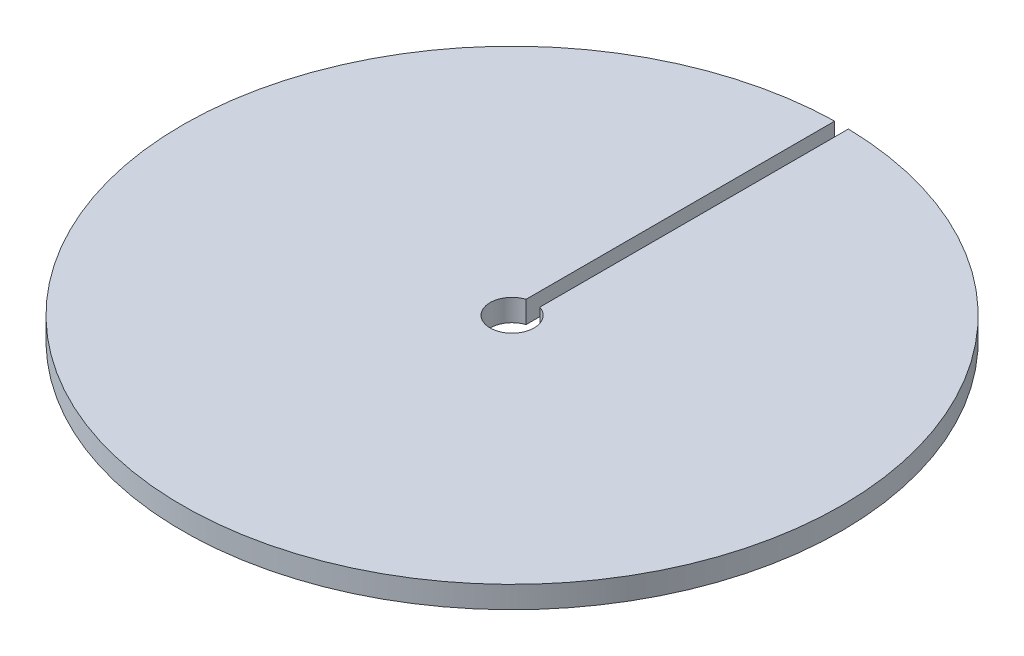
ISO-10303-21;
HEADER;
FILE_DESCRIPTION(('STEP AP214'),'2;1');
FILE_NAME('part.step','',(''),(''),'','','');
FILE_SCHEMA(('AUTOMOTIVE_DESIGN { 1 0 10303 214 1 1 1 1 }'));
ENDSEC;
DATA;
#1=APPLICATION_CONTEXT('core data for automotive mechanical design processes');
#2=APPLICATION_PROTOCOL_DEFINITION('international standard','automotive_design',2000,#1);
#3=PRODUCT_CONTEXT('',#1,'mechanical');
#4=PRODUCT('Part','Part','',(#3));
#5=PRODUCT_RELATED_PRODUCT_CATEGORY('part','',(#4));
#6=PRODUCT_DEFINITION_FORMATION('','',#4);
#7=PRODUCT_DEFINITION_CONTEXT('part definition',#1,'design');
#8=PRODUCT_DEFINITION('design','',#6,#7);
#9=PRODUCT_DEFINITION_SHAPE('','',#8);
#10=(LENGTH_UNIT() NAMED_UNIT(*) SI_UNIT(.MILLI.,.METRE.));
#11=(NAMED_UNIT(*) PLANE_ANGLE_UNIT() SI_UNIT($,.RADIAN.));
#12=(NAMED_UNIT(*) SI_UNIT($,.STERADIAN.) SOLID_ANGLE_UNIT());
#13=UNCERTAINTY_MEASURE_WITH_UNIT(LENGTH_MEASURE(1.E-05),#10,'distance_accuracy_value','');
#14=(GEOMETRIC_REPRESENTATION_CONTEXT(3) GLOBAL_UNCERTAINTY_ASSIGNED_CONTEXT((#13)) GLOBAL_UNIT_ASSIGNED_CONTEXT((#10,
#11,#12)) REPRESENTATION_CONTEXT('',''));
#15=CARTESIAN_POINT('',(0.,0.,0.));
#16=DIRECTION('',(0.,0.,1.));
#17=DIRECTION('',(1.,0.,0.));
#18=AXIS2_PLACEMENT_3D('',#15,#16,#17);
#19=CARTESIAN_POINT('',(0.,6.35,0.));
#20=DIRECTION('',(0.,-1.,0.));
#21=DIRECTION('',(0.,0.,-1.));
#22=AXIS2_PLACEMENT_3D('',#19,#20,#21);
#23=CYLINDRICAL_SURFACE('',#22,6.35);
#24=CARTESIAN_POINT('',(0.,0.,0.));
#25=DIRECTION('',(0.,1.,0.));
#26=DIRECTION('',(0.,0.,1.));
#27=AXIS2_PLACEMENT_3D('',#24,#25,#26);
#28=CIRCLE('',#27,6.35);
#29=CARTESIAN_POINT('',(-1.97715599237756,0.,-6.0343478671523));
#30=VERTEX_POINT('',#29);
#31=CARTESIAN_POINT('',(1.97715599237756,0.,-6.0343478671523));
#32=VERTEX_POINT('',#31);
#33=EDGE_CURVE('E98',#30,#32,#28,.T.);
#34=ORIENTED_EDGE('',*,*,#33,.F.);
#35=DIRECTION('',(0.,-1.,0.));
#36=VECTOR('',#35,1.);
#37=CARTESIAN_POINT('',(-1.97715599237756,6.35,-6.0343478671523));
#38=LINE('',#37,#36);
#39=CARTESIAN_POINT('',(-1.97715599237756,6.35,-6.0343478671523));
#40=VERTEX_POINT('',#39);
#41=EDGE_CURVE('E11',#40,#30,#38,.T.);
#42=ORIENTED_EDGE('',*,*,#41,.F.);
#43=CARTESIAN_POINT('',(0.,6.35,0.));
#44=DIRECTION('',(0.,1.,0.));
#45=DIRECTION('',(0.,0.,1.));
#46=AXIS2_PLACEMENT_3D('',#43,#44,#45);
#47=CIRCLE('',#46,6.35);
#48=CARTESIAN_POINT('',(1.97715599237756,6.35,-6.0343478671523));
#49=VERTEX_POINT('',#48);
#50=EDGE_CURVE('E83',#40,#49,#47,.T.);
#51=ORIENTED_EDGE('',*,*,#50,.T.);
#52=DIRECTION('',(0.,-1.,0.));
#53=VECTOR('',#52,1.);
#54=CARTESIAN_POINT('',(1.97715599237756,6.35,-6.0343478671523));
#55=LINE('',#54,#53);
#56=EDGE_CURVE('E51',#49,#32,#55,.T.);
#57=ORIENTED_EDGE('',*,*,#56,.T.);
#58=EDGE_LOOP('',(#34,#42,#51,#57));
#59=FACE_BOUND('',#58,.T.);
#60=ADVANCED_FACE('F35',(#59),#23,.F.);
#61=CARTESIAN_POINT('',(-1.97715599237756,6.35,0.));
#62=DIRECTION('',(-1.,0.,0.));
#63=DIRECTION('',(0.,0.,1.));
#64=AXIS2_PLACEMENT_3D('',#61,#62,#63);
#65=PLANE('',#64);
#66=DIRECTION('',(0.,0.,-1.));
#67=VECTOR('',#66,1.);
#68=CARTESIAN_POINT('',(-1.97715599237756,0.,0.));
#69=LINE('',#68,#67);
#70=CARTESIAN_POINT('',(-1.97715599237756,0.,-95.2294773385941));
#71=VERTEX_POINT('',#70);
#72=EDGE_CURVE('E89',#30,#71,#69,.T.);
#73=ORIENTED_EDGE('',*,*,#72,.T.);
#74=DIRECTION('',(0.,-1.,0.));
#75=VECTOR('',#74,1.);
#76=CARTESIAN_POINT('',(-1.97715599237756,6.35,-95.2294773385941));
#77=LINE('',#76,#75);
#78=CARTESIAN_POINT('',(-1.97715599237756,6.35,-95.2294773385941));
#79=VERTEX_POINT('',#78);
#80=EDGE_CURVE('E43',#79,#71,#77,.T.);
#81=ORIENTED_EDGE('',*,*,#80,.F.);
#82=DIRECTION('',(0.,0.,-1.));
#83=VECTOR('',#82,1.);
#84=CARTESIAN_POINT('',(-1.97715599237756,6.35,0.));
#85=LINE('',#84,#83);
#86=EDGE_CURVE('E77',#40,#79,#85,.T.);
#87=ORIENTED_EDGE('',*,*,#86,.F.);
#88=ORIENTED_EDGE('',*,*,#41,.T.);
#89=EDGE_LOOP('',(#73,#81,#87,#88));
#90=FACE_BOUND('',#89,.T.);
#91=ADVANCED_FACE('F87',(#90),#65,.F.);
#92=CARTESIAN_POINT('',(0.,6.35,0.));
#93=DIRECTION('',(0.,-1.,0.));
#94=DIRECTION('',(0.,0.,-1.));
#95=AXIS2_PLACEMENT_3D('',#92,#93,#94);
#96=CYLINDRICAL_SURFACE('',#95,95.25);
#97=CARTESIAN_POINT('',(0.,0.,0.));
#98=DIRECTION('',(0.,1.,0.));
#99=DIRECTION('',(0.,0.,1.));
#100=AXIS2_PLACEMENT_3D('',#97,#98,#99);
#101=CIRCLE('',#100,95.25);
#102=CARTESIAN_POINT('',(1.97715599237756,0.,-95.2294773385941));
#103=VERTEX_POINT('',#102);
#104=EDGE_CURVE('E101',#71,#103,#101,.T.);
#105=ORIENTED_EDGE('',*,*,#104,.T.);
#106=DIRECTION('',(0.,-1.,0.));
#107=VECTOR('',#106,1.);
#108=CARTESIAN_POINT('',(1.97715599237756,6.35,-95.2294773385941));
#109=LINE('',#108,#107);
#110=CARTESIAN_POINT('',(1.97715599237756,6.35,-95.2294773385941));
#111=VERTEX_POINT('',#110);
#112=EDGE_CURVE('E65',#111,#103,#109,.T.);
#113=ORIENTED_EDGE('',*,*,#112,.F.);
#114=CARTESIAN_POINT('',(0.,6.35,0.));
#115=DIRECTION('',(0.,1.,0.));
#116=DIRECTION('',(0.,0.,1.));
#117=AXIS2_PLACEMENT_3D('',#114,#115,#116);
#118=CIRCLE('',#117,95.25);
#119=EDGE_CURVE('E82',#79,#111,#118,.T.);
#120=ORIENTED_EDGE('',*,*,#119,.F.);
#121=ORIENTED_EDGE('',*,*,#80,.T.);
#122=EDGE_LOOP('',(#105,#113,#120,#121));
#123=FACE_BOUND('',#122,.T.);
#124=ADVANCED_FACE('F92',(#123),#96,.T.);
#125=CARTESIAN_POINT('',(1.97715599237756,6.35,0.));
#126=DIRECTION('',(-1.,0.,0.));
#127=DIRECTION('',(0.,0.,1.));
#128=AXIS2_PLACEMENT_3D('',#125,#126,#127);
#129=PLANE('',#128);
#130=DIRECTION('',(0.,0.,-1.));
#131=VECTOR('',#130,1.);
#132=CARTESIAN_POINT('',(1.97715599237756,0.,0.));
#133=LINE('',#132,#131);
#134=EDGE_CURVE('E103',#32,#103,#133,.T.);
#135=ORIENTED_EDGE('',*,*,#134,.F.);
#136=ORIENTED_EDGE('',*,*,#56,.F.);
#137=DIRECTION('',(0.,0.,-1.));
#138=VECTOR('',#137,1.);
#139=CARTESIAN_POINT('',(1.97715599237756,6.35,0.));
#140=LINE('',#139,#138);
#141=EDGE_CURVE('E93',#49,#111,#140,.T.);
#142=ORIENTED_EDGE('',*,*,#141,.T.);
#143=ORIENTED_EDGE('',*,*,#112,.T.);
#144=EDGE_LOOP('',(#135,#136,#142,#143));
#145=FACE_BOUND('',#144,.T.);
#146=ADVANCED_FACE('F108',(#145),#129,.T.);
#147=CARTESIAN_POINT('',(0.,6.35,0.));
#148=DIRECTION('',(0.,1.,0.));
#149=DIRECTION('',(0.,0.,1.));
#150=AXIS2_PLACEMENT_3D('',#147,#148,#149);
#151=PLANE('',#150);
#152=ORIENTED_EDGE('',*,*,#50,.F.);
#153=ORIENTED_EDGE('',*,*,#86,.T.);
#154=ORIENTED_EDGE('',*,*,#119,.T.);
#155=ORIENTED_EDGE('',*,*,#141,.F.);
#156=EDGE_LOOP('',(#152,#153,#154,#155));
#157=FACE_BOUND('',#156,.T.);
#158=ADVANCED_FACE('F79',(#157),#151,.T.);
#159=CARTESIAN_POINT('',(0.,0.,0.));
#160=DIRECTION('',(0.,1.,0.));
#161=DIRECTION('',(0.,0.,1.));
#162=AXIS2_PLACEMENT_3D('',#159,#160,#161);
#163=PLANE('',#162);
#164=ORIENTED_EDGE('',*,*,#33,.T.);
#165=ORIENTED_EDGE('',*,*,#134,.T.);
#166=ORIENTED_EDGE('',*,*,#104,.F.);
#167=ORIENTED_EDGE('',*,*,#72,.F.);
#168=EDGE_LOOP('',(#164,#165,#166,#167));
#169=FACE_BOUND('',#168,.T.);
#170=ADVANCED_FACE('F115',(#169),#163,.F.);
#171=CLOSED_SHELL('',(#60,#91,#124,#146,#158,#170));
#172=MANIFOLD_SOLID_BREP('B2',#171);
#173=ADVANCED_BREP_SHAPE_REPRESENTATION('',(#18,#172),#14);
#174=SHAPE_DEFINITION_REPRESENTATION(#9,#173);
ENDSEC;
END-ISO-10303-21;
